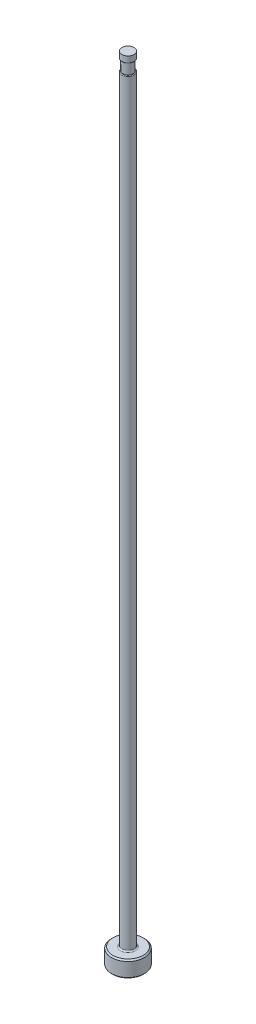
ISO-10303-21;
HEADER;
FILE_DESCRIPTION(('STEP AP214'),'2;1');
FILE_NAME('part.step','',(''),(''),'','','');
FILE_SCHEMA(('AUTOMOTIVE_DESIGN { 1 0 10303 214 1 1 1 1 }'));
ENDSEC;
DATA;
#1=APPLICATION_CONTEXT('core data for automotive mechanical design processes');
#2=APPLICATION_PROTOCOL_DEFINITION('international standard','automotive_design',2000,#1);
#3=PRODUCT_CONTEXT('',#1,'mechanical');
#4=PRODUCT('Part','Part','',(#3));
#5=PRODUCT_RELATED_PRODUCT_CATEGORY('part','',(#4));
#6=PRODUCT_DEFINITION_FORMATION('','',#4);
#7=PRODUCT_DEFINITION_CONTEXT('part definition',#1,'design');
#8=PRODUCT_DEFINITION('design','',#6,#7);
#9=PRODUCT_DEFINITION_SHAPE('','',#8);
#10=(LENGTH_UNIT() NAMED_UNIT(*) SI_UNIT(.MILLI.,.METRE.));
#11=(NAMED_UNIT(*) PLANE_ANGLE_UNIT() SI_UNIT($,.RADIAN.));
#12=(NAMED_UNIT(*) SI_UNIT($,.STERADIAN.) SOLID_ANGLE_UNIT());
#13=UNCERTAINTY_MEASURE_WITH_UNIT(LENGTH_MEASURE(1.E-05),#10,'distance_accuracy_value','');
#14=(GEOMETRIC_REPRESENTATION_CONTEXT(3) GLOBAL_UNCERTAINTY_ASSIGNED_CONTEXT((#13)) GLOBAL_UNIT_ASSIGNED_CONTEXT((#10,
#11,#12)) REPRESENTATION_CONTEXT('',''));
#15=CARTESIAN_POINT('',(0.,0.,0.));
#16=DIRECTION('',(0.,0.,1.));
#17=DIRECTION('',(1.,0.,0.));
#18=AXIS2_PLACEMENT_3D('',#15,#16,#17);
#19=CARTESIAN_POINT('',(-1.18998999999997,151.13,0.));
#20=DIRECTION('',(0.,1.,0.));
#21=DIRECTION('',(0.,0.,1.));
#22=AXIS2_PLACEMENT_3D('',#19,#20,#21);
#23=PLANE('',#22);
#24=CARTESIAN_POINT('',(0.,151.13,0.));
#25=DIRECTION('',(0.,1.,0.));
#26=DIRECTION('',(0.,0.,1.));
#27=AXIS2_PLACEMENT_3D('',#24,#25,#26);
#28=CIRCLE('',#27,1.04393999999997);
#29=CARTESIAN_POINT('',(0.,151.13,1.04393999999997));
#30=VERTEX_POINT('',#29);
#31=EDGE_CURVE('E11',#30,#30,#28,.F.);
#32=ORIENTED_EDGE('',*,*,#31,.T.);
#33=EDGE_LOOP('',(#32));
#34=FACE_BOUND('',#33,.T.);
#35=CARTESIAN_POINT('',(0.,151.13,0.));
#36=DIRECTION('',(0.,1.,0.));
#37=DIRECTION('',(0.,0.,1.));
#38=AXIS2_PLACEMENT_3D('',#35,#36,#37);
#39=CIRCLE('',#38,0.986789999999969);
#40=CARTESIAN_POINT('',(0.,151.13,0.986789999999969));
#41=VERTEX_POINT('',#40);
#42=EDGE_CURVE('E78',#41,#41,#39,.T.);
#43=ORIENTED_EDGE('',*,*,#42,.T.);
#44=EDGE_LOOP('',(#43));
#45=FACE_BOUND('',#44,.T.);
#46=ADVANCED_FACE('F36',(#34,#45),#23,.F.);
#47=CARTESIAN_POINT('',(0.,259.958771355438,0.));
#48=DIRECTION('',(0.,1.,0.));
#49=DIRECTION('',(0.,0.,1.));
#50=AXIS2_PLACEMENT_3D('',#47,#48,#49);
#51=CYLINDRICAL_SURFACE('',#50,1.18998999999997);
#52=DIRECTION('',(0.,1.,0.));
#53=VECTOR('',#52,1.);
#54=CARTESIAN_POINT('',(-0.986789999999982,259.958771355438,-0.66507269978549));
#55=LINE('',#54,#53);
#56=CARTESIAN_POINT('',(-0.986789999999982,148.971,-0.66507269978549));
#57=VERTEX_POINT('',#56);
#58=CARTESIAN_POINT('',(-0.986789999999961,86.614,-0.665072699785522));
#59=VERTEX_POINT('',#58);
#60=EDGE_CURVE('E73',#57,#59,#55,.F.);
#61=ORIENTED_EDGE('',*,*,#60,.F.);
#62=CARTESIAN_POINT('',(0.,148.971,0.));
#63=DIRECTION('',(0.,-1.,0.));
#64=DIRECTION('',(0.,0.,-1.));
#65=AXIS2_PLACEMENT_3D('',#62,#63,#64);
#66=CIRCLE('',#65,1.18998999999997);
#67=CARTESIAN_POINT('',(-0.986789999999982,148.971,0.66507269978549));
#68=VERTEX_POINT('',#67);
#69=EDGE_CURVE('E51',#57,#68,#66,.T.);
#70=ORIENTED_EDGE('',*,*,#69,.T.);
#71=DIRECTION('',(0.,1.,0.));
#72=VECTOR('',#71,1.);
#73=CARTESIAN_POINT('',(-0.986789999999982,259.958771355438,0.66507269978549));
#74=LINE('',#73,#72);
#75=CARTESIAN_POINT('',(-0.986789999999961,86.614,0.665072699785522));
#76=VERTEX_POINT('',#75);
#77=EDGE_CURVE('E84',#76,#68,#74,.T.);
#78=ORIENTED_EDGE('',*,*,#77,.F.);
#79=CARTESIAN_POINT('',(-0.98678999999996,86.614,-0.665072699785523));
#80=CARTESIAN_POINT('',(-0.986779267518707,86.563745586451,-0.66504129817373));
#81=CARTESIAN_POINT('',(-0.987982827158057,86.5134764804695,-0.663300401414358));
#82=CARTESIAN_POINT('',(-0.992752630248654,86.4131549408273,-0.656166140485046));
#83=CARTESIAN_POINT('',(-0.996326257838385,86.3631036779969,-0.650761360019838));
#84=CARTESIAN_POINT('',(-1.00583006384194,86.2631462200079,-0.635968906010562));
#85=CARTESIAN_POINT('',(-1.01178989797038,86.2132501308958,-0.626531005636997));
#86=CARTESIAN_POINT('',(-1.02587369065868,86.1148860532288,-0.603197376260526));
#87=CARTESIAN_POINT('',(-1.03399424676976,86.0664159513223,-0.589308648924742));
#88=CARTESIAN_POINT('',(-1.05174573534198,85.9733689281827,-0.556987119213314));
#89=CARTESIAN_POINT('',(-1.06130874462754,85.9287141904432,-0.538743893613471));
#90=CARTESIAN_POINT('',(-1.08163376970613,85.8425015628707,-0.496679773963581));
#91=CARTESIAN_POINT('',(-1.09239187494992,85.8009342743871,-0.472876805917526));
#92=CARTESIAN_POINT('',(-1.11191043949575,85.7308889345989,-0.424562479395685));
#93=CARTESIAN_POINT('',(-1.12059949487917,85.7015247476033,-0.401318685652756));
#94=CARTESIAN_POINT('',(-1.13756139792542,85.6467968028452,-0.350355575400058));
#95=CARTESIAN_POINT('',(-1.1458348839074,85.6214267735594,-0.322643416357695));
#96=CARTESIAN_POINT('',(-1.15898696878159,85.5824463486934,-0.270798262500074));
#97=CARTESIAN_POINT('',(-1.16417674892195,85.5675145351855,-0.24774326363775));
#98=CARTESIAN_POINT('',(-1.17342649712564,85.5413860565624,-0.199376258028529));
#99=CARTESIAN_POINT('',(-1.17748715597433,85.5301871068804,-0.174065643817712));
#100=CARTESIAN_POINT('',(-1.18407630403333,85.5122102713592,-0.121438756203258));
#101=CARTESIAN_POINT('',(-1.18659047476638,85.5054736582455,-0.0941062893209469));
#102=CARTESIAN_POINT('',(-1.18968900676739,85.4971911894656,-0.0385610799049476));
#103=CARTESIAN_POINT('',(-1.19027509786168,85.4956406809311,-0.0103491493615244));
#104=CARTESIAN_POINT('',(-1.18949770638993,85.4977102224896,0.0419738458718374));
#105=CARTESIAN_POINT('',(-1.18838954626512,85.5006530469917,0.0661187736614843));
#106=CARTESIAN_POINT('',(-1.18479997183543,85.5102873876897,0.113537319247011));
#107=CARTESIAN_POINT('',(-1.1823183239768,85.5169795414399,0.136810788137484));
#108=CARTESIAN_POINT('',(-1.17619659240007,85.533751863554,0.18211276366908));
#109=CARTESIAN_POINT('',(-1.17254841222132,85.5438557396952,0.204131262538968));
#110=CARTESIAN_POINT('',(-1.16439345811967,85.5669140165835,0.24643226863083));
#111=CARTESIAN_POINT('',(-1.15988634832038,85.5798695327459,0.266714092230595));
#112=CARTESIAN_POINT('',(-1.14755888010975,85.6162124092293,0.316494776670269));
#113=CARTESIAN_POINT('',(-1.13931800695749,85.6413279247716,0.344629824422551));
#114=CARTESIAN_POINT('',(-1.12235845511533,85.6956867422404,0.396399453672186));
#115=CARTESIAN_POINT('',(-1.11363866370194,85.7249399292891,0.420022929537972));
#116=CARTESIAN_POINT('',(-1.09186647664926,85.8024930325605,0.47452003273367));
#117=CARTESIAN_POINT('',(-1.07894485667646,85.8527247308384,0.502681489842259));
#118=CARTESIAN_POINT('',(-1.05496207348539,85.957372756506,0.55123785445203));
#119=CARTESIAN_POINT('',(-1.04391025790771,86.0118082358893,0.571594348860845));
#120=CARTESIAN_POINT('',(-1.02648158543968,86.1115321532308,0.602203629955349));
#121=CARTESIAN_POINT('',(-1.01961050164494,86.156371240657,0.613676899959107));
#122=CARTESIAN_POINT('',(-1.00772789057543,86.2471036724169,0.633000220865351));
#123=CARTESIAN_POINT('',(-1.00271814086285,86.2929979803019,0.640846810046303));
#124=CARTESIAN_POINT('',(-0.99475556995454,86.384656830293,0.653140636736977));
#125=CARTESIAN_POINT('',(-0.991771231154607,86.4304117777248,0.657640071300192));
#126=CARTESIAN_POINT('',(-0.987786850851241,86.5221143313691,0.663592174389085));
#127=CARTESIAN_POINT('',(-0.986782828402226,86.5680613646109,0.665050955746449));
#128=CARTESIAN_POINT('',(-0.98678999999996,86.614,0.665072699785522));
#129=B_SPLINE_CURVE_WITH_KNOTS('',3,(#79,#80,#81,#82,#83,#84,#85,#86,#87,#88,#89,#90,#91,#92,
#93,#94,#95,#96,#97,#98,#99,#100,#101,#102,#103,#104,#105,#106,#107,#108,#109,#110,#111,#112,
#113,#114,#115,#116,#117,#118,#119,#120,#121,#122,#123,#124,#125,#126,#127,#128),.UNSPECIFIED.,
.F.,.F.,(4,2,2,2,2,2,2,2,2,2,2,2,2,2,2,2,2,2,2,2,2,2,2,2,4),(0.,0.150742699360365,
0.301957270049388,0.455112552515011,0.608028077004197,0.75521904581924,0.901941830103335,
1.01691912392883,1.13171404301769,1.21527204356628,1.29877881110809,1.3830475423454,
1.46724064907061,1.53993547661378,1.61264266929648,1.68586586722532,1.75911775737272,
1.87427009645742,1.98970233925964,2.16578434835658,2.34272217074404,2.48289840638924,
2.62320816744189,2.7612811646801,2.8990763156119),.UNSPECIFIED.);
#130=EDGE_CURVE('E81',#59,#76,#129,.T.);
#131=ORIENTED_EDGE('',*,*,#130,.F.);
#132=EDGE_LOOP('',(#61,#70,#78,#131));
#133=FACE_BOUND('',#132,.T.);
#134=CARTESIAN_POINT('',(0.,3.42900000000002,0.));
#135=DIRECTION('',(0.,1.,0.));
#136=DIRECTION('',(0.,0.,1.));
#137=AXIS2_PLACEMENT_3D('',#134,#135,#136);
#138=CIRCLE('',#137,1.18998999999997);
#139=CARTESIAN_POINT('',(0.,3.42900000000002,1.18998999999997));
#140=VERTEX_POINT('',#139);
#141=EDGE_CURVE('E116',#140,#140,#138,.T.);
#142=ORIENTED_EDGE('',*,*,#141,.T.);
#143=EDGE_LOOP('',(#142));
#144=FACE_BOUND('',#143,.T.);
#145=ADVANCED_FACE('F82',(#133,#144),#51,.T.);
#146=CARTESIAN_POINT('',(0.,0.,0.));
#147=DIRECTION('',(0.,-1.,0.));
#148=DIRECTION('',(0.,0.,-1.));
#149=AXIS2_PLACEMENT_3D('',#146,#147,#148);
#150=PLANE('',#149);
#151=CARTESIAN_POINT('',(0.,0.,0.));
#152=DIRECTION('',(0.,-1.,0.));
#153=DIRECTION('',(0.,0.,-1.));
#154=AXIS2_PLACEMENT_3D('',#151,#152,#153);
#155=CIRCLE('',#154,2.92099999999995);
#156=CARTESIAN_POINT('',(0.,0.,-2.92099999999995));
#157=VERTEX_POINT('',#156);
#158=EDGE_CURVE('E113',#157,#157,#155,.T.);
#159=ORIENTED_EDGE('',*,*,#158,.T.);
#160=EDGE_LOOP('',(#159));
#161=FACE_BOUND('',#160,.T.);
#162=ADVANCED_FACE('F192',(#161),#150,.T.);
#163=CARTESIAN_POINT('',(0.,259.958771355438,0.));
#164=DIRECTION('',(0.,1.,0.));
#165=DIRECTION('',(0.,0.,1.));
#166=AXIS2_PLACEMENT_3D('',#163,#164,#165);
#167=CYLINDRICAL_SURFACE('',#166,3.17499999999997);
#168=CARTESIAN_POINT('',(0.,2.92100000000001,0.));
#169=DIRECTION('',(0.,1.,0.));
#170=DIRECTION('',(0.,0.,1.));
#171=AXIS2_PLACEMENT_3D('',#168,#169,#170);
#172=CIRCLE('',#171,3.17499999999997);
#173=CARTESIAN_POINT('',(0.,2.92100000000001,3.17499999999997));
#174=VERTEX_POINT('',#173);
#175=EDGE_CURVE('E110',#174,#174,#172,.F.);
#176=ORIENTED_EDGE('',*,*,#175,.T.);
#177=EDGE_LOOP('',(#176));
#178=FACE_BOUND('',#177,.T.);
#179=CARTESIAN_POINT('',(0.,0.254000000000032,0.));
#180=DIRECTION('',(0.,-1.,0.));
#181=DIRECTION('',(0.,0.,-1.));
#182=AXIS2_PLACEMENT_3D('',#179,#180,#181);
#183=CIRCLE('',#182,3.17499999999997);
#184=CARTESIAN_POINT('',(0.,0.254000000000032,-3.17499999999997));
#185=VERTEX_POINT('',#184);
#186=EDGE_CURVE('E107',#185,#185,#183,.F.);
#187=ORIENTED_EDGE('',*,*,#186,.T.);
#188=EDGE_LOOP('',(#187));
#189=FACE_BOUND('',#188,.T.);
#190=ADVANCED_FACE('F195',(#178,#189),#167,.T.);
#191=CARTESIAN_POINT('',(-3.17499999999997,3.175,0.));
#192=DIRECTION('',(0.,1.,0.));
#193=DIRECTION('',(0.,0.,1.));
#194=AXIS2_PLACEMENT_3D('',#191,#192,#193);
#195=PLANE('',#194);
#196=CARTESIAN_POINT('',(0.,3.175,0.));
#197=DIRECTION('',(0.,1.,0.));
#198=DIRECTION('',(0.,0.,1.));
#199=AXIS2_PLACEMENT_3D('',#196,#197,#198);
#200=CIRCLE('',#199,1.44398999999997);
#201=CARTESIAN_POINT('',(0.,3.175,1.44398999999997));
#202=VERTEX_POINT('',#201);
#203=EDGE_CURVE('E87',#202,#202,#200,.F.);
#204=ORIENTED_EDGE('',*,*,#203,.T.);
#205=EDGE_LOOP('',(#204));
#206=FACE_BOUND('',#205,.T.);
#207=CARTESIAN_POINT('',(0.,3.175,0.));
#208=DIRECTION('',(0.,1.,0.));
#209=DIRECTION('',(0.,0.,1.));
#210=AXIS2_PLACEMENT_3D('',#207,#208,#209);
#211=CIRCLE('',#210,2.92099999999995);
#212=CARTESIAN_POINT('',(0.,3.175,2.92099999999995));
#213=VERTEX_POINT('',#212);
#214=EDGE_CURVE('E104',#213,#213,#211,.T.);
#215=ORIENTED_EDGE('',*,*,#214,.T.);
#216=EDGE_LOOP('',(#215));
#217=FACE_BOUND('',#216,.T.);
#218=ADVANCED_FACE('F190',(#206,#217),#195,.T.);
#219=CARTESIAN_POINT('',(0.,3.17499999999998,0.));
#220=DIRECTION('',(0.,-1.,0.));
#221=DIRECTION('',(0.,0.,-1.));
#222=AXIS2_PLACEMENT_3D('',#219,#220,#221);
#223=CONICAL_SURFACE('',#222,2.92099999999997,0.7853981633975);
#224=ORIENTED_EDGE('',*,*,#175,.F.);
#225=EDGE_LOOP('',(#224));
#226=FACE_BOUND('',#225,.T.);
#227=ORIENTED_EDGE('',*,*,#214,.F.);
#228=EDGE_LOOP('',(#227));
#229=FACE_BOUND('',#228,.T.);
#230=ADVANCED_FACE('F186',(#226,#229),#223,.T.);
#231=CARTESIAN_POINT('',(0.,0.254000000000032,0.));
#232=DIRECTION('',(0.,1.,0.));
#233=DIRECTION('',(0.,0.,1.));
#234=AXIS2_PLACEMENT_3D('',#231,#232,#233);
#235=CONICAL_SURFACE('',#234,3.17499999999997,0.785398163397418);
#236=ORIENTED_EDGE('',*,*,#158,.F.);
#237=EDGE_LOOP('',(#236));
#238=FACE_BOUND('',#237,.T.);
#239=ORIENTED_EDGE('',*,*,#186,.F.);
#240=EDGE_LOOP('',(#239));
#241=FACE_BOUND('',#240,.T.);
#242=ADVANCED_FACE('F182',(#238,#241),#235,.T.);
#243=CARTESIAN_POINT('',(0.,3.42900000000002,0.));
#244=DIRECTION('',(0.,1.,0.));
#245=DIRECTION('',(0.,0.,1.));
#246=AXIS2_PLACEMENT_3D('',#243,#244,#245);
#247=TOROIDAL_SURFACE('',#246,1.44398999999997,0.254);
#248=ORIENTED_EDGE('',*,*,#203,.F.);
#249=EDGE_LOOP('',(#248));
#250=FACE_BOUND('',#249,.T.);
#251=ORIENTED_EDGE('',*,*,#141,.F.);
#252=EDGE_LOOP('',(#251));
#253=FACE_BOUND('',#252,.T.);
#254=ADVANCED_FACE('F147',(#250,#253),#247,.F.);
#255=CARTESIAN_POINT('',(-1.18998999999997,149.098,0.));
#256=DIRECTION('',(0.,-1.,0.));
#257=DIRECTION('',(0.,0.,-1.));
#258=AXIS2_PLACEMENT_3D('',#255,#256,#257);
#259=PLANE('',#258);
#260=DIRECTION('',(0.,0.,1.));
#261=VECTOR('',#260,1.);
#262=CARTESIAN_POINT('',(-0.986789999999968,149.098,0.));
#263=LINE('',#262,#261);
#264=CARTESIAN_POINT('',(-0.986789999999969,149.098,0.));
#265=VERTEX_POINT('',#264);
#266=CARTESIAN_POINT('',(-0.986789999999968,149.098,0.39521289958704));
#267=VERTEX_POINT('',#266);
#268=EDGE_CURVE('E90',#265,#267,#263,.T.);
#269=ORIENTED_EDGE('',*,*,#268,.T.);
#270=CARTESIAN_POINT('',(0.,149.098,0.));
#271=DIRECTION('',(0.,-1.,0.));
#272=DIRECTION('',(0.,0.,-1.));
#273=AXIS2_PLACEMENT_3D('',#270,#271,#272);
#274=CIRCLE('',#273,1.06298999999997);
#275=CARTESIAN_POINT('',(-0.986789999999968,149.098,-0.39521289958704));
#276=VERTEX_POINT('',#275);
#277=EDGE_CURVE('E86',#267,#276,#274,.F.);
#278=ORIENTED_EDGE('',*,*,#277,.T.);
#279=EDGE_CURVE('E79',#276,#265,#263,.T.);
#280=ORIENTED_EDGE('',*,*,#279,.T.);
#281=CARTESIAN_POINT('',(0.,149.098,0.));
#282=DIRECTION('',(0.,1.,0.));
#283=DIRECTION('',(0.,0.,1.));
#284=AXIS2_PLACEMENT_3D('',#281,#282,#283);
#285=CIRCLE('',#284,0.986789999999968);
#286=EDGE_CURVE('E101',#265,#265,#285,.T.);
#287=ORIENTED_EDGE('',*,*,#286,.F.);
#288=EDGE_LOOP('',(#269,#278,#280,#287));
#289=FACE_BOUND('',#288,.T.);
#290=ADVANCED_FACE('F144',(#289),#259,.F.);
#291=CARTESIAN_POINT('',(0.,153.448281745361,0.));
#292=DIRECTION('',(0.,1.,0.));
#293=DIRECTION('',(0.,0.,1.));
#294=AXIS2_PLACEMENT_3D('',#291,#292,#293);
#295=CYLINDRICAL_SURFACE('',#294,0.986789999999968);
#296=ORIENTED_EDGE('',*,*,#42,.F.);
#297=EDGE_LOOP('',(#296));
#298=FACE_BOUND('',#297,.T.);
#299=ORIENTED_EDGE('',*,*,#286,.T.);
#300=EDGE_LOOP('',(#299));
#301=FACE_BOUND('',#300,.T.);
#302=ADVANCED_FACE('F141',(#298,#301),#295,.T.);
#303=CARTESIAN_POINT('',(-0.986789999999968,150.114,-3.17499999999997));
#304=DIRECTION('',(1.,0.,0.));
#305=DIRECTION('',(0.,1.,0.));
#306=AXIS2_PLACEMENT_3D('',#303,#304,#305);
#307=PLANE('',#306);
#308=ORIENTED_EDGE('',*,*,#279,.F.);
#309=CARTESIAN_POINT('',(-0.986789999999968,149.098,-0.39521289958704));
#310=CARTESIAN_POINT('',(-0.986789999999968,149.097995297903,-0.407444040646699));
#311=CARTESIAN_POINT('',(-0.986789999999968,149.097755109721,-0.419683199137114));
#312=CARTESIAN_POINT('',(-0.986789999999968,149.096653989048,-0.444183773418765));
#313=CARTESIAN_POINT('',(-0.986789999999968,149.095790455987,-0.456445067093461));
#314=CARTESIAN_POINT('',(-0.986789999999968,149.093278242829,-0.481011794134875));
#315=CARTESIAN_POINT('',(-0.986789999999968,149.091621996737,-0.493316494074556));
#316=CARTESIAN_POINT('',(-0.986789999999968,149.087322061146,-0.517737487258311));
#317=CARTESIAN_POINT('',(-0.986789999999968,149.084680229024,-0.529854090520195));
#318=CARTESIAN_POINT('',(-0.986789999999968,149.079166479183,-0.550007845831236));
#319=CARTESIAN_POINT('',(-0.986789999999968,149.076625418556,-0.558134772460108));
#320=CARTESIAN_POINT('',(-0.986789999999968,149.070838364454,-0.574135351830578));
#321=CARTESIAN_POINT('',(-0.986789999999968,149.06759268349,-0.582009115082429));
#322=CARTESIAN_POINT('',(-0.986789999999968,149.060227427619,-0.597422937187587));
#323=CARTESIAN_POINT('',(-0.986789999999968,149.05610093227,-0.604959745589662));
#324=CARTESIAN_POINT('',(-0.986789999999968,149.04681754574,-0.619377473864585));
#325=CARTESIAN_POINT('',(-0.986789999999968,149.041662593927,-0.626259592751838));
#326=CARTESIAN_POINT('',(-0.986789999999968,149.032322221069,-0.636549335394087));
#327=CARTESIAN_POINT('',(-0.986789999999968,149.028503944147,-0.640288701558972));
#328=CARTESIAN_POINT('',(-0.986789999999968,149.020372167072,-0.647191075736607));
#329=CARTESIAN_POINT('',(-0.986789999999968,149.01605907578,-0.650354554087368));
#330=CARTESIAN_POINT('',(-0.986789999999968,149.007638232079,-0.655489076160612));
#331=CARTESIAN_POINT('',(-0.986789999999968,149.003596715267,-0.657567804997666));
#332=CARTESIAN_POINT('',(-0.986789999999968,148.995227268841,-0.661024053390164));
#333=CARTESIAN_POINT('',(-0.986789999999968,148.99090005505,-0.662403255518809));
#334=CARTESIAN_POINT('',(-0.986789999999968,148.98394708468,-0.663934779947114));
#335=CARTESIAN_POINT('',(-0.986789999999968,148.981379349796,-0.664359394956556));
#336=CARTESIAN_POINT('',(-0.986789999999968,148.976208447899,-0.664929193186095));
#337=CARTESIAN_POINT('',(-0.986789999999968,148.973605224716,-0.665073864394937));
#338=CARTESIAN_POINT('',(-0.986789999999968,148.971000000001,-0.665072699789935));
#339=B_SPLINE_CURVE_WITH_KNOTS('',3,(#309,#310,#311,#312,#313,#314,#315,#316,#317,#318,#319,
#320,#321,#322,#323,#324,#325,#326,#327,#328,#329,#330,#331,#332,#333,#334,#335,#336,#337,#338),
.UNSPECIFIED.,.F.,.F.,(4,2,2,2,2,2,2,2,2,2,2,2,2,2,4),(0.,0.0367035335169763,0.0735610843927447,
0.110777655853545,0.147924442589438,0.173443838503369,0.198951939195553,0.224668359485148,
0.250336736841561,0.266328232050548,0.282306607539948,0.295888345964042,0.309437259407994,
0.317231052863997,0.325039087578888),.UNSPECIFIED.);
#340=EDGE_CURVE('E59',#276,#57,#339,.T.);
#341=ORIENTED_EDGE('',*,*,#340,.T.);
#342=ORIENTED_EDGE('',*,*,#60,.T.);
#343=DIRECTION('',(0.,0.,1.));
#344=VECTOR('',#343,1.);
#345=CARTESIAN_POINT('',(-0.986789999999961,86.614,-3.17499999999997));
#346=LINE('',#345,#344);
#347=EDGE_CURVE('E77',#59,#76,#346,.T.);
#348=ORIENTED_EDGE('',*,*,#347,.T.);
#349=ORIENTED_EDGE('',*,*,#77,.T.);
#350=CARTESIAN_POINT('',(-0.986789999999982,148.971,0.66507269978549));
#351=CARTESIAN_POINT('',(-0.986789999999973,148.975976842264,0.665089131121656));
#352=CARTESIAN_POINT('',(-0.986789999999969,148.980932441,0.664550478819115));
#353=CARTESIAN_POINT('',(-0.986789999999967,148.990580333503,0.662514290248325));
#354=CARTESIAN_POINT('',(-0.986789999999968,148.995275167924,0.661028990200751));
#355=CARTESIAN_POINT('',(-0.986789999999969,149.004292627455,0.657253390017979));
#356=CARTESIAN_POINT('',(-0.986789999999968,149.00861696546,0.654967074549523));
#357=CARTESIAN_POINT('',(-0.986789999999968,149.016874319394,0.649756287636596));
#358=CARTESIAN_POINT('',(-0.986789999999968,149.02080595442,0.646829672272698));
#359=CARTESIAN_POINT('',(-0.986789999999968,149.030276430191,0.638773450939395));
#360=CARTESIAN_POINT('',(-0.986789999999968,149.035529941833,0.633310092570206));
#361=CARTESIAN_POINT('',(-0.986789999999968,149.045132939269,0.62165056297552));
#362=CARTESIAN_POINT('',(-0.986789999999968,149.049480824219,0.615453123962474));
#363=CARTESIAN_POINT('',(-0.986789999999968,149.060260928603,0.59794170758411));
#364=CARTESIAN_POINT('',(-0.986789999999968,149.065932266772,0.586163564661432));
#365=CARTESIAN_POINT('',(-0.986789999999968,149.075557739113,0.561881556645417));
#366=CARTESIAN_POINT('',(-0.986789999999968,149.079500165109,0.54937337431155));
#367=CARTESIAN_POINT('',(-0.986789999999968,149.085776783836,0.525021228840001));
#368=CARTESIAN_POINT('',(-0.986789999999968,149.088213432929,0.513202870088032));
#369=CARTESIAN_POINT('',(-0.986789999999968,149.092177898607,0.489402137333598));
#370=CARTESIAN_POINT('',(-0.986789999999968,149.093704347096,0.477419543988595));
#371=CARTESIAN_POINT('',(-0.986789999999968,149.095993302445,0.453722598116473));
#372=CARTESIAN_POINT('',(-0.986789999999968,149.096775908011,0.442010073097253));
#373=CARTESIAN_POINT('',(-0.986789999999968,149.097776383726,0.418600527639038));
#374=CARTESIAN_POINT('',(-0.986789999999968,149.097996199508,0.406903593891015));
#375=CARTESIAN_POINT('',(-0.986789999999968,149.098,0.395212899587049));
#376=B_SPLINE_CURVE_WITH_KNOTS('',3,(#350,#351,#352,#353,#354,#355,#356,#357,#358,#359,#360,
#361,#362,#363,#364,#365,#366,#367,#368,#369,#370,#371,#372,#373,#374,#375),.UNSPECIFIED.,.F.,
.F.,(4,2,2,2,2,2,2,2,2,2,2,2,4),(0.,0.0148678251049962,0.0295472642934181,0.0441546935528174,
0.0588118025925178,0.0814211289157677,0.104070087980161,0.143067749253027,0.182325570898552,
0.218481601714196,0.254691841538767,0.289893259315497,0.324972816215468),.UNSPECIFIED.);
#377=EDGE_CURVE('E172',#68,#267,#376,.T.);
#378=ORIENTED_EDGE('',*,*,#377,.T.);
#379=ORIENTED_EDGE('',*,*,#268,.F.);
#380=EDGE_LOOP('',(#308,#341,#342,#348,#349,#378,#379));
#381=FACE_BOUND('',#380,.T.);
#382=ADVANCED_FACE('F75',(#381),#307,.F.);
#383=CARTESIAN_POINT('',(-4.16178999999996,86.614,-3.17499999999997));
#384=DIRECTION('',(0.,0.,1.));
#385=DIRECTION('',(1.,0.,0.));
#386=AXIS2_PLACEMENT_3D('',#383,#384,#385);
#387=CYLINDRICAL_SURFACE('',#386,3.175);
#388=ORIENTED_EDGE('',*,*,#347,.F.);
#389=ORIENTED_EDGE('',*,*,#130,.T.);
#390=EDGE_LOOP('',(#388,#389));
#391=FACE_BOUND('',#390,.T.);
#392=ADVANCED_FACE('F89',(#391),#387,.F.);
#393=CARTESIAN_POINT('',(0.,152.687735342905,0.));
#394=DIRECTION('',(0.,1.,0.));
#395=DIRECTION('',(0.,0.,1.));
#396=AXIS2_PLACEMENT_3D('',#393,#394,#395);
#397=CYLINDRICAL_SURFACE('',#396,1.17093999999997);
#398=CARTESIAN_POINT('',(0.,151.257,0.));
#399=DIRECTION('',(0.,1.,0.));
#400=DIRECTION('',(0.,0.,1.));
#401=AXIS2_PLACEMENT_3D('',#398,#399,#400);
#402=CIRCLE('',#401,1.17093999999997);
#403=CARTESIAN_POINT('',(0.,151.257,1.17093999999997));
#404=VERTEX_POINT('',#403);
#405=EDGE_CURVE('E44',#404,#404,#402,.T.);
#406=ORIENTED_EDGE('',*,*,#405,.T.);
#407=EDGE_LOOP('',(#406));
#408=FACE_BOUND('',#407,.T.);
#409=CARTESIAN_POINT('',(0.,152.4,0.));
#410=DIRECTION('',(0.,1.,0.));
#411=DIRECTION('',(0.,0.,1.));
#412=AXIS2_PLACEMENT_3D('',#409,#410,#411);
#413=CIRCLE('',#412,1.17093999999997);
#414=CARTESIAN_POINT('',(0.,152.4,1.17093999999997));
#415=VERTEX_POINT('',#414);
#416=EDGE_CURVE('E91',#415,#415,#413,.T.);
#417=ORIENTED_EDGE('',*,*,#416,.F.);
#418=EDGE_LOOP('',(#417));
#419=FACE_BOUND('',#418,.T.);
#420=ADVANCED_FACE('F135',(#408,#419),#397,.T.);
#421=CARTESIAN_POINT('',(-1.18998999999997,152.4,0.));
#422=DIRECTION('',(0.,1.,0.));
#423=DIRECTION('',(0.,0.,1.));
#424=AXIS2_PLACEMENT_3D('',#421,#422,#423);
#425=PLANE('',#424);
#426=ORIENTED_EDGE('',*,*,#416,.T.);
#427=EDGE_LOOP('',(#426));
#428=FACE_BOUND('',#427,.T.);
#429=ADVANCED_FACE('F149',(#428),#425,.T.);
#430=CARTESIAN_POINT('',(0.,148.971,0.));
#431=DIRECTION('',(0.,-1.,0.));
#432=DIRECTION('',(0.,0.,-1.));
#433=AXIS2_PLACEMENT_3D('',#430,#431,#432);
#434=TOROIDAL_SURFACE('',#433,1.06298999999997,0.127);
#435=ORIENTED_EDGE('',*,*,#377,.F.);
#436=ORIENTED_EDGE('',*,*,#69,.F.);
#437=ORIENTED_EDGE('',*,*,#340,.F.);
#438=ORIENTED_EDGE('',*,*,#277,.F.);
#439=EDGE_LOOP('',(#435,#436,#437,#438));
#440=FACE_BOUND('',#439,.T.);
#441=ADVANCED_FACE('F151',(#440),#434,.T.);
#442=CARTESIAN_POINT('',(0.,151.257,0.));
#443=DIRECTION('',(0.,1.,0.));
#444=DIRECTION('',(0.,0.,1.));
#445=AXIS2_PLACEMENT_3D('',#442,#443,#444);
#446=TOROIDAL_SURFACE('',#445,1.04393999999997,0.127);
#447=ORIENTED_EDGE('',*,*,#31,.F.);
#448=EDGE_LOOP('',(#447));
#449=FACE_BOUND('',#448,.T.);
#450=ORIENTED_EDGE('',*,*,#405,.F.);
#451=EDGE_LOOP('',(#450));
#452=FACE_BOUND('',#451,.T.);
#453=ADVANCED_FACE('F38',(#449,#452),#446,.T.);
#454=CLOSED_SHELL('',(#46,#145,#162,#190,#218,#230,#242,#254,#290,#302,#382,#392,#420,#429,#441,#453));
#455=MANIFOLD_SOLID_BREP('B2',#454);
#456=ADVANCED_BREP_SHAPE_REPRESENTATION('',(#18,#455),#14);
#457=SHAPE_DEFINITION_REPRESENTATION(#9,#456);
ENDSEC;
END-ISO-10303-21;
